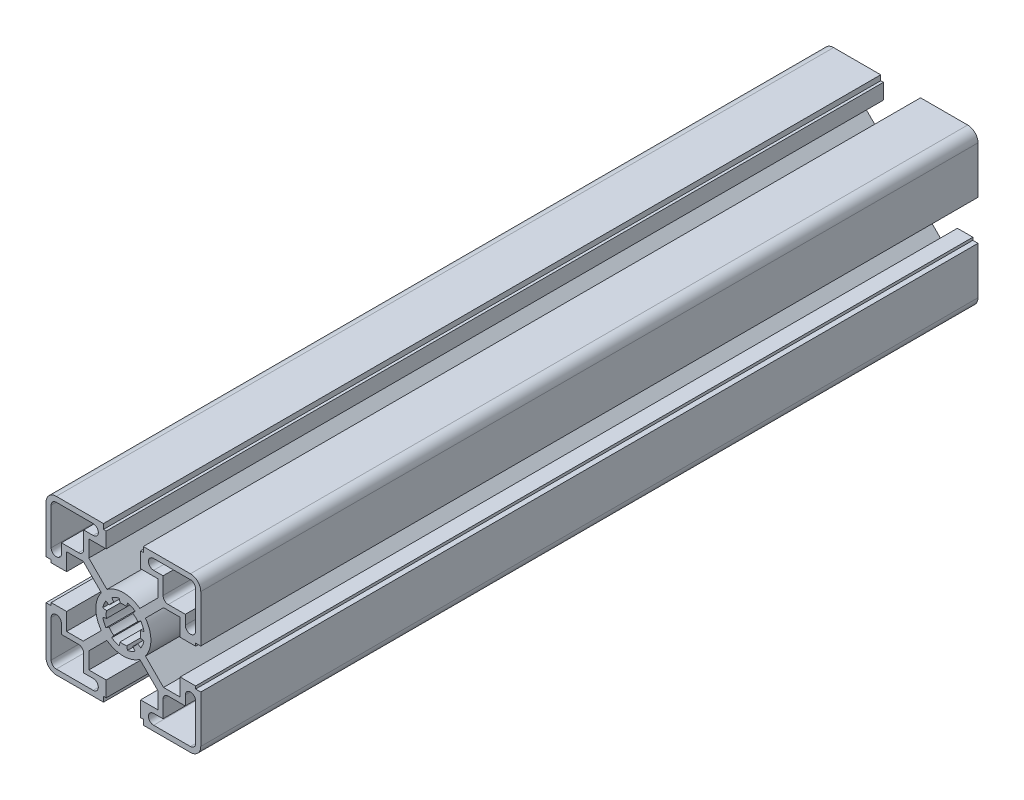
from build123d import *

# Parameters (mm, degrees)
BOSS_EXTRUDE1_DEPTH = 113.03


with BuildPart() as part:
    # Sketch1 → Boss-Extrude1 (new, symmetric)
    with BuildSketch(Plane.XY):
        with BuildLine():
            Line((-19.5072, 22.5044), (-5.7912, 22.5044))
            Line((-5.7912, 22.5044), (-5.7912, 21.0058))
            Line((-5.7912, 21.0058), (-5.0038, 21.0058))
            Line((-5.0038, 21.0058), (-5.0038, 16.51))
            Line((-5.0038, 16.51), (-10.0457, 16.51))
            Line((-10.0457, 16.51), (-10.0457, 11.680106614))
            Line((-10.0457, 11.680106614), (-4.781026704, 6.415433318))
            ThreePointArc((-4.781026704, 6.415433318), (0, 8.001), (4.781026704, 6.415433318))
            Line((4.781026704, 6.415433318), (10.0457, 11.680106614))
            Line((10.0457, 11.680106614), (10.0457, 16.51))
            Line((10.0457, 16.51), (5.0038, 16.51))
            Line((5.0038, 16.51), (5.0038, 21.0058))
            Line((5.0038, 21.0058), (5.7912, 21.0058))
            Line((5.7912, 21.0058), (5.7912, 22.5044))
            Line((5.7912, 22.5044), (19.5072, 22.5044))
            ThreePointArc((19.5072, 22.5044), (21.626540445, 21.626540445), (22.5044, 19.5072))
            Line((22.5044, 19.5072), (22.5044, 5.7912))
            Line((22.5044, 5.7912), (21.0058, 5.7912))
            Line((21.0058, 5.7912), (21.0058, 5.0038))
            Line((21.0058, 5.0038), (16.51, 5.0038))
            Line((16.51, 5.0038), (16.51, 10.0457))
            Line((16.51, 10.0457), (11.680106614, 10.0457))
            Line((11.680106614, 10.0457), (6.415433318, 4.781026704))
            ThreePointArc((6.415433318, 4.781026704), (8.001, 0), (6.415433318, -4.781026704))
            Line((6.415433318, -4.781026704), (11.680106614, -10.0457))
            Line((11.680106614, -10.0457), (16.51, -10.0457))
            Line((16.51, -10.0457), (16.51, -5.0038))
            Line((16.51, -5.0038), (21.0058, -5.0038))
            Line((21.0058, -5.0038), (21.0058, -5.7912))
            Line((21.0058, -5.7912), (22.5044, -5.7912))
            Line((22.5044, -5.7912), (22.5044, -19.5072))
            ThreePointArc((22.5044, -19.5072), (21.626540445, -21.626540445), (19.5072, -22.5044))
            Line((19.5072, -22.5044), (5.7912, -22.5044))
            Line((5.7912, -22.5044), (5.7912, -21.0058))
            Line((5.7912, -21.0058), (5.0038, -21.0058))
            Line((5.0038, -21.0058), (5.0038, -16.51))
            Line((5.0038, -16.51), (10.0457, -16.51))
            Line((10.0457, -16.51), (10.0457, -11.680106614))
            Line((10.0457, -11.680106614), (4.781026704, -6.415433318))
            ThreePointArc((4.781026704, -6.415433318), (0, -8.001), (-4.781026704, -6.415433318))
            Line((-4.781026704, -6.415433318), (-10.0457, -11.680106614))
            Line((-10.0457, -11.680106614), (-10.0457, -16.51))
            Line((-10.0457, -16.51), (-5.0038, -16.51))
            Line((-5.0038, -16.51), (-5.0038, -21.0058))
            Line((-5.0038, -21.0058), (-5.7912, -21.0058))
            Line((-5.7912, -21.0058), (-5.7912, -22.5044))
            Line((-5.7912, -22.5044), (-19.5072, -22.5044))
            ThreePointArc((-19.5072, -22.5044), (-21.626540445, -21.626540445), (-22.5044, -19.5072))
            Line((-22.5044, -19.5072), (-22.5044, -5.7912))
            Line((-22.5044, -5.7912), (-21.0058, -5.7912))
            Line((-21.0058, -5.7912), (-21.0058, -5.0038))
            Line((-21.0058, -5.0038), (-16.51, -5.0038))
            Line((-16.51, -5.0038), (-16.51, -10.0457))
            Line((-16.51, -10.0457), (-11.680106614, -10.0457))
            Line((-11.680106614, -10.0457), (-6.415433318, -4.781026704))
            ThreePointArc((-6.415433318, -4.781026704), (-8.001, 0), (-6.415433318, 4.781026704))
            Line((-6.415433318, 4.781026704), (-11.680106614, 10.0457))
            Line((-11.680106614, 10.0457), (-16.51, 10.0457))
            Line((-16.51, 10.0457), (-16.51, 5.0038))
            Line((-16.51, 5.0038), (-21.0058, 5.0038))
            Line((-21.0058, 5.0038), (-21.0058, 5.7912))
            Line((-21.0058, 5.7912), (-22.5044, 5.7912))
            Line((-22.5044, 5.7912), (-22.5044, 19.5072))
            ThreePointArc((-22.5044, 19.5072), (-21.626540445, 21.626540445), (-19.5072, 22.5044))
        make_face()
        with BuildLine():
            Line((-18.0086, 11.5443), (-13.0429, 11.5443))
            ThreePointArc((-13.0429, 11.5443), (-11.983229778, 11.983229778), (-11.5443, 13.0429))
            Line((-11.5443, 13.0429), (-11.5443, 18.0086))
            Line((-11.5443, 18.0086), (-8.7884, 18.0086))
            ThreePointArc((-8.7884, 18.0086), (-7.2898, 19.5072), (-8.7884, 21.0058))
            Line((-8.7884, 21.0058), (-19.5072, 21.0058))
            ThreePointArc((-19.5072, 21.0058), (-20.566870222, 20.566870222), (-21.0058, 19.5072))
            Line((-21.0058, 19.5072), (-21.0058, 8.7884))
            ThreePointArc((-21.0058, 8.7884), (-19.5072, 7.2898), (-18.0086, 8.7884))
            Line((-18.0086, 8.7884), (-18.0086, 11.5443))
        make_face(mode=Mode.SUBTRACT)
        with BuildLine():
            Line((1.189270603, 5.978867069), (0.976192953, 4.907653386))
            ThreePointArc((0.976192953, 4.907653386), (0, 5.0038), (-0.976192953, 4.907653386))
            Line((-0.976192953, 4.907653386), (-1.189270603, 5.978867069))
            ThreePointArc((-1.189270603, 5.978867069), (-2.332838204, 5.63196963), (-3.38675614, 5.068638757))
            Line((-3.38675614, 5.068638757), (-2.779962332, 4.160507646))
            ThreePointArc((-2.779962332, 4.160507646), (-3.538220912, 3.538220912), (-4.160507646, 2.779962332))
            Line((-4.160507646, 2.779962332), (-5.068638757, 3.38675614))
            ThreePointArc((-5.068638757, 3.38675614), (-5.63196963, 2.332838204), (-5.978867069, 1.189270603))
            Line((-5.978867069, 1.189270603), (-4.907653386, 0.976192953))
            ThreePointArc((-4.907653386, 0.976192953), (-5.0038, 0), (-4.907653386, -0.976192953))
            Line((-4.907653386, -0.976192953), (-5.978867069, -1.189270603))
            ThreePointArc((-5.978867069, -1.189270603), (-5.63196963, -2.332838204), (-5.068638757, -3.38675614))
            Line((-5.068638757, -3.38675614), (-4.160507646, -2.779962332))
            ThreePointArc((-4.160507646, -2.779962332), (-3.538220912, -3.538220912), (-2.779962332, -4.160507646))
            Line((-2.779962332, -4.160507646), (-3.38675614, -5.068638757))
            ThreePointArc((-3.38675614, -5.068638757), (-2.332838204, -5.63196963), (-1.189270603, -5.978867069))
            Line((-1.189270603, -5.978867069), (-0.976192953, -4.907653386))
            ThreePointArc((-0.976192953, -4.907653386), (0, -5.0038), (0.976192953, -4.907653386))
            Line((0.976192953, -4.907653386), (1.189270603, -5.978867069))
            ThreePointArc((1.189270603, -5.978867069), (2.332838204, -5.63196963), (3.38675614, -5.068638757))
            Line((3.38675614, -5.068638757), (2.779962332, -4.160507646))
            ThreePointArc((2.779962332, -4.160507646), (3.538220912, -3.538220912), (4.160507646, -2.779962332))
            Line((4.160507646, -2.779962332), (5.068638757, -3.38675614))
            ThreePointArc((5.068638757, -3.38675614), (5.63196963, -2.332838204), (5.978867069, -1.189270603))
            Line((5.978867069, -1.189270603), (4.907653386, -0.976192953))
            ThreePointArc((4.907653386, -0.976192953), (5.0038, 0), (4.907653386, 0.976192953))
            Line((4.907653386, 0.976192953), (5.978867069, 1.189270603))
            ThreePointArc((5.978867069, 1.189270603), (5.63196963, 2.332838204), (5.068638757, 3.38675614))
            Line((5.068638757, 3.38675614), (4.160507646, 2.779962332))
            ThreePointArc((4.160507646, 2.779962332), (3.538220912, 3.538220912), (2.779962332, 4.160507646))
            Line((2.779962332, 4.160507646), (3.38675614, 5.068638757))
            ThreePointArc((3.38675614, 5.068638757), (2.332838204, 5.63196963), (1.189270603, 5.978867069))
        make_face(mode=Mode.SUBTRACT)
        with BuildLine():
            Line((11.5443, 18.0086), (8.7884, 18.0086))
            ThreePointArc((8.7884, 18.0086), (7.2898, 19.5072), (8.7884, 21.0058))
            Line((8.7884, 21.0058), (19.5072, 21.0058))
            ThreePointArc((19.5072, 21.0058), (20.566870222, 20.566870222), (21.0058, 19.5072))
            Line((21.0058, 19.5072), (21.0058, 8.7884))
            ThreePointArc((21.0058, 8.7884), (19.5072, 7.2898), (18.0086, 8.7884))
            Line((18.0086, 8.7884), (18.0086, 11.5443))
            Line((18.0086, 11.5443), (13.0429, 11.5443))
            ThreePointArc((13.0429, 11.5443), (11.983229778, 11.983229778), (11.5443, 13.0429))
            Line((11.5443, 13.0429), (11.5443, 18.0086))
        make_face(mode=Mode.SUBTRACT)
        with BuildLine():
            Line((18.0086, -11.5443), (13.0429, -11.5443))
            ThreePointArc((13.0429, -11.5443), (11.983229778, -11.983229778), (11.5443, -13.0429))
            Line((11.5443, -13.0429), (11.5443, -18.0086))
            Line((11.5443, -18.0086), (8.7884, -18.0086))
            ThreePointArc((8.7884, -18.0086), (7.2898, -19.5072), (8.7884, -21.0058))
            Line((8.7884, -21.0058), (19.5072, -21.0058))
            ThreePointArc((19.5072, -21.0058), (20.566870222, -20.566870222), (21.0058, -19.5072))
            Line((21.0058, -19.5072), (21.0058, -8.7884))
            ThreePointArc((21.0058, -8.7884), (19.5072, -7.2898), (18.0086, -8.7884))
            Line((18.0086, -8.7884), (18.0086, -11.5443))
        make_face(mode=Mode.SUBTRACT)
        with BuildLine():
            Line((-11.5443, -18.0086), (-8.7884, -18.0086))
            ThreePointArc((-8.7884, -18.0086), (-7.2898, -19.5072), (-8.7884, -21.0058))
            Line((-8.7884, -21.0058), (-19.5072, -21.0058))
            ThreePointArc((-19.5072, -21.0058), (-20.566870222, -20.566870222), (-21.0058, -19.5072))
            Line((-21.0058, -19.5072), (-21.0058, -8.7884))
            ThreePointArc((-21.0058, -8.7884), (-19.5072, -7.2898), (-18.0086, -8.7884))
            Line((-18.0086, -8.7884), (-18.0086, -11.5443))
            Line((-18.0086, -11.5443), (-13.0429, -11.5443))
            ThreePointArc((-13.0429, -11.5443), (-11.983229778, -11.983229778), (-11.5443, -13.0429))
            Line((-11.5443, -13.0429), (-11.5443, -18.0086))
        make_face(mode=Mode.SUBTRACT)
    extrude(amount=BOSS_EXTRUDE1_DEPTH, both=True)


solid = part.part
